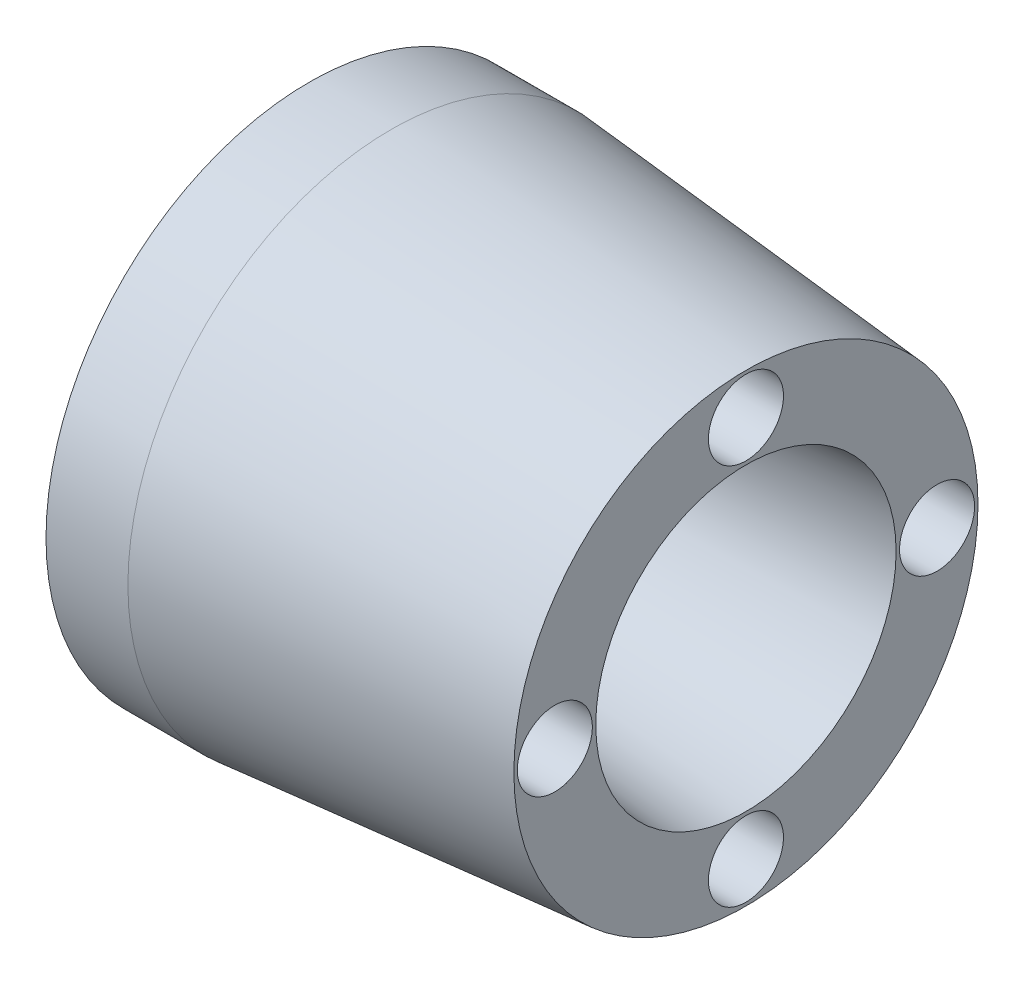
from build123d import *

# Parameters (mm, degrees)
SKETCH2_R          = 1.375
CUT_EXTRUDE1_DEPTH = 15
CIRPATTERN1_COUNT  = 4


with BuildPart() as part:
    # Sketch1 → Revolve1 (revolve)
    with BuildSketch(Plane.XY, mode=Mode.PRIVATE) as revolve1_sk:
        Polygon((16, 8.4997994), (3, 9.637152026), (0, 9.637152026), (0, 4.362847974), (3, 4.362847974), (16, 5.5002006), align=None)
    revolve(revolve1_sk.sketch.rotate(Axis((0, 0, 0), (1, 0, 0)), 90), axis=Axis((0, 0, 0), (1, 0, 0)))

    # Sketch2 → Cut-Extrude1 (cut)
    with BuildSketch(Plane(origin=(16, 0, 0), x_dir=(0, 0, -1), z_dir=(1, 0, 0))):
        with Locations((0, 7)):
            Circle(SKETCH2_R)
    cut_extrude1 = extrude(amount=-CUT_EXTRUDE1_DEPTH, mode=Mode.SUBTRACT)

    # CirPattern1: Cut-Extrude1 ×4 about axis
    cirpattern1_axis = Axis((0, 0, 0), (1, 0, 0))
    for i in range(1, CIRPATTERN1_COUNT):
        add(cut_extrude1.rotate(cirpattern1_axis, i * 360 / CIRPATTERN1_COUNT), mode=Mode.SUBTRACT)


solid = part.part
